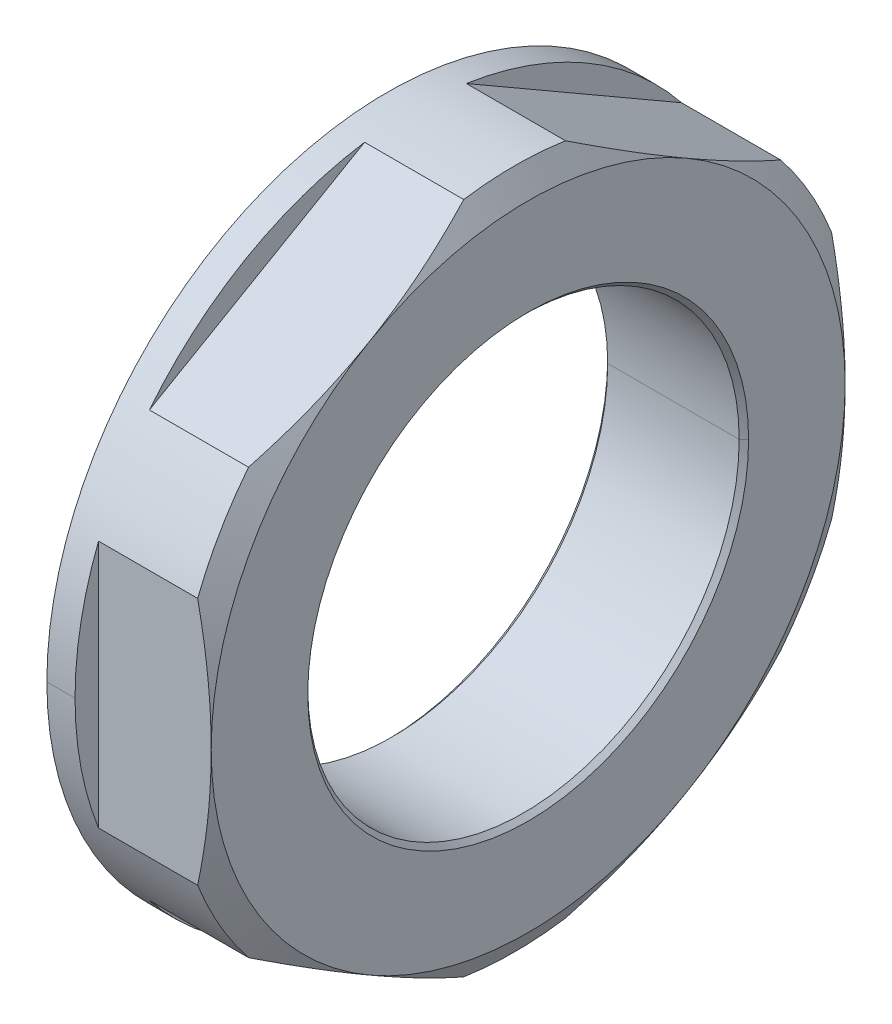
ISO-10303-21;
HEADER;
FILE_DESCRIPTION(('STEP AP214'),'2;1');
FILE_NAME('part.step','',(''),(''),'','','');
FILE_SCHEMA(('AUTOMOTIVE_DESIGN { 1 0 10303 214 1 1 1 1 }'));
ENDSEC;
DATA;
#1=APPLICATION_CONTEXT('core data for automotive mechanical design processes');
#2=APPLICATION_PROTOCOL_DEFINITION('international standard','automotive_design',2000,#1);
#3=PRODUCT_CONTEXT('',#1,'mechanical');
#4=PRODUCT('Part','Part','',(#3));
#5=PRODUCT_RELATED_PRODUCT_CATEGORY('part','',(#4));
#6=PRODUCT_DEFINITION_FORMATION('','',#4);
#7=PRODUCT_DEFINITION_CONTEXT('part definition',#1,'design');
#8=PRODUCT_DEFINITION('design','',#6,#7);
#9=PRODUCT_DEFINITION_SHAPE('','',#8);
#10=(LENGTH_UNIT() NAMED_UNIT(*) SI_UNIT(.MILLI.,.METRE.));
#11=(NAMED_UNIT(*) PLANE_ANGLE_UNIT() SI_UNIT($,.RADIAN.));
#12=(NAMED_UNIT(*) SI_UNIT($,.STERADIAN.) SOLID_ANGLE_UNIT());
#13=UNCERTAINTY_MEASURE_WITH_UNIT(LENGTH_MEASURE(1.E-05),#10,'distance_accuracy_value','');
#14=(GEOMETRIC_REPRESENTATION_CONTEXT(3) GLOBAL_UNCERTAINTY_ASSIGNED_CONTEXT((#13)) GLOBAL_UNIT_ASSIGNED_CONTEXT((#10,
#11,#12)) REPRESENTATION_CONTEXT('',''));
#15=CARTESIAN_POINT('',(0.,0.,0.));
#16=DIRECTION('',(0.,0.,1.));
#17=DIRECTION('',(1.,0.,0.));
#18=AXIS2_PLACEMENT_3D('',#15,#16,#17);
#19=CARTESIAN_POINT('',(6.,0.,0.));
#20=DIRECTION('',(1.,0.,0.));
#21=DIRECTION('',(0.,1.,0.));
#22=AXIS2_PLACEMENT_3D('',#19,#20,#21);
#23=CYLINDRICAL_SURFACE('',#22,14.5);
#24=DIRECTION('',(1.,0.,0.));
#25=VECTOR('',#24,1.);
#26=CARTESIAN_POINT('',(0.,0.,14.5));
#27=LINE('',#26,#25);
#28=CARTESIAN_POINT('',(0.,0.,14.5));
#29=VERTEX_POINT('',#28);
#30=CARTESIAN_POINT('',(1.2,0.,14.5));
#31=VERTEX_POINT('',#30);
#32=EDGE_CURVE('E9',#29,#31,#27,.T.);
#33=ORIENTED_EDGE('',*,*,#32,.F.);
#34=CARTESIAN_POINT('',(0.,0.,0.));
#35=DIRECTION('',(1.,0.,0.));
#36=DIRECTION('',(0.,0.,-1.));
#37=AXIS2_PLACEMENT_3D('',#34,#35,#36);
#38=CIRCLE('',#37,14.5);
#39=CARTESIAN_POINT('',(0.,0.,-14.5));
#40=VERTEX_POINT('',#39);
#41=EDGE_CURVE('E23',#29,#40,#38,.T.);
#42=ORIENTED_EDGE('',*,*,#41,.T.);
#43=DIRECTION('',(1.,0.,0.));
#44=VECTOR('',#43,1.);
#45=CARTESIAN_POINT('',(0.,0.,-14.5));
#46=LINE('',#45,#44);
#47=CARTESIAN_POINT('',(1.2,0.,-14.5));
#48=VERTEX_POINT('',#47);
#49=EDGE_CURVE('E369',#40,#48,#46,.T.);
#50=ORIENTED_EDGE('',*,*,#49,.T.);
#51=CARTESIAN_POINT('',(1.2,0.,0.));
#52=DIRECTION('',(1.,0.,0.));
#53=DIRECTION('',(0.,0.,-1.));
#54=AXIS2_PLACEMENT_3D('',#51,#52,#53);
#55=CIRCLE('',#54,14.5);
#56=CARTESIAN_POINT('',(1.2,-5.29150262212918,-13.5));
#57=VERTEX_POINT('',#56);
#58=EDGE_CURVE('E364',#57,#48,#55,.T.);
#59=ORIENTED_EDGE('',*,*,#58,.F.);
#60=DIRECTION('',(-1.,0.,0.));
#61=VECTOR('',#60,1.);
#62=CARTESIAN_POINT('',(6.,-5.29150262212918,-13.5));
#63=LINE('',#62,#61);
#64=CARTESIAN_POINT('',(5.4226497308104,-5.29150262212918,-13.5));
#65=VERTEX_POINT('',#64);
#66=EDGE_CURVE('E352',#65,#57,#63,.T.);
#67=ORIENTED_EDGE('',*,*,#66,.F.);
#68=CARTESIAN_POINT('',(5.4226497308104,0.,0.));
#69=DIRECTION('',(1.,0.,0.));
#70=DIRECTION('',(0.,0.,-1.));
#71=AXIS2_PLACEMENT_3D('',#68,#69,#70);
#72=CIRCLE('',#71,14.5);
#73=CARTESIAN_POINT('',(5.4226497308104,-9.04559164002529,-11.3325756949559));
#74=VERTEX_POINT('',#73);
#75=EDGE_CURVE('E171',#74,#65,#72,.T.);
#76=ORIENTED_EDGE('',*,*,#75,.F.);
#77=DIRECTION('',(1.,0.,0.));
#78=VECTOR('',#77,1.);
#79=CARTESIAN_POINT('',(6.,-9.0455916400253,-11.3325756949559));
#80=LINE('',#79,#78);
#81=CARTESIAN_POINT('',(1.2,-9.0455916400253,-11.3325756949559));
#82=VERTEX_POINT('',#81);
#83=EDGE_CURVE('E346',#82,#74,#80,.T.);
#84=ORIENTED_EDGE('',*,*,#83,.F.);
#85=CARTESIAN_POINT('',(1.2,0.,0.));
#86=DIRECTION('',(1.,0.,0.));
#87=DIRECTION('',(0.,0.,-1.));
#88=AXIS2_PLACEMENT_3D('',#85,#86,#87);
#89=CIRCLE('',#88,14.5);
#90=CARTESIAN_POINT('',(1.2,-14.3370942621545,-2.16742430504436));
#91=VERTEX_POINT('',#90);
#92=EDGE_CURVE('E350',#91,#82,#89,.T.);
#93=ORIENTED_EDGE('',*,*,#92,.F.);
#94=DIRECTION('',(-1.,0.,0.));
#95=VECTOR('',#94,1.);
#96=CARTESIAN_POINT('',(6.,-14.3370942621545,-2.16742430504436));
#97=LINE('',#96,#95);
#98=CARTESIAN_POINT('',(5.4226497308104,-14.3370942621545,-2.16742430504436));
#99=VERTEX_POINT('',#98);
#100=EDGE_CURVE('E354',#99,#91,#97,.T.);
#101=ORIENTED_EDGE('',*,*,#100,.F.);
#102=CARTESIAN_POINT('',(5.4226497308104,0.,0.));
#103=DIRECTION('',(1.,0.,0.));
#104=DIRECTION('',(0.,0.,-1.));
#105=AXIS2_PLACEMENT_3D('',#102,#103,#104);
#106=CIRCLE('',#105,14.5);
#107=CARTESIAN_POINT('',(5.4226497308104,-14.3370942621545,2.16742430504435));
#108=VERTEX_POINT('',#107);
#109=EDGE_CURVE('E727',#108,#99,#106,.T.);
#110=ORIENTED_EDGE('',*,*,#109,.F.);
#111=DIRECTION('',(1.,0.,0.));
#112=VECTOR('',#111,1.);
#113=CARTESIAN_POINT('',(6.,-14.3370942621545,2.16742430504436));
#114=LINE('',#113,#112);
#115=CARTESIAN_POINT('',(1.2,-14.3370942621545,2.16742430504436));
#116=VERTEX_POINT('',#115);
#117=EDGE_CURVE('E729',#116,#108,#114,.T.);
#118=ORIENTED_EDGE('',*,*,#117,.F.);
#119=CARTESIAN_POINT('',(1.2,0.,0.));
#120=DIRECTION('',(1.,0.,0.));
#121=DIRECTION('',(0.,0.,-1.));
#122=AXIS2_PLACEMENT_3D('',#119,#120,#121);
#123=CIRCLE('',#122,14.5);
#124=CARTESIAN_POINT('',(1.2,-9.04559164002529,11.3325756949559));
#125=VERTEX_POINT('',#124);
#126=EDGE_CURVE('E731',#125,#116,#123,.T.);
#127=ORIENTED_EDGE('',*,*,#126,.F.);
#128=DIRECTION('',(-1.,0.,0.));
#129=VECTOR('',#128,1.);
#130=CARTESIAN_POINT('',(6.,-9.04559164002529,11.3325756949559));
#131=LINE('',#130,#129);
#132=CARTESIAN_POINT('',(5.4226497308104,-9.04559164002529,11.3325756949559));
#133=VERTEX_POINT('',#132);
#134=EDGE_CURVE('E744',#133,#125,#131,.T.);
#135=ORIENTED_EDGE('',*,*,#134,.F.);
#136=CARTESIAN_POINT('',(5.4226497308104,0.,0.));
#137=DIRECTION('',(1.,0.,0.));
#138=DIRECTION('',(0.,0.,-1.));
#139=AXIS2_PLACEMENT_3D('',#136,#137,#138);
#140=CIRCLE('',#139,14.5);
#141=CARTESIAN_POINT('',(5.4226497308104,-5.29150262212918,13.5));
#142=VERTEX_POINT('',#141);
#143=EDGE_CURVE('E718',#142,#133,#140,.T.);
#144=ORIENTED_EDGE('',*,*,#143,.F.);
#145=DIRECTION('',(1.,0.,0.));
#146=VECTOR('',#145,1.);
#147=CARTESIAN_POINT('',(6.,-5.29150262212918,13.5));
#148=LINE('',#147,#146);
#149=CARTESIAN_POINT('',(1.2,-5.29150262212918,13.5));
#150=VERTEX_POINT('',#149);
#151=EDGE_CURVE('E751',#150,#142,#148,.T.);
#152=ORIENTED_EDGE('',*,*,#151,.F.);
#153=CARTESIAN_POINT('',(1.2,0.,0.));
#154=DIRECTION('',(1.,0.,0.));
#155=DIRECTION('',(0.,0.,-1.));
#156=AXIS2_PLACEMENT_3D('',#153,#154,#155);
#157=CIRCLE('',#156,14.5);
#158=EDGE_CURVE('E755',#31,#150,#157,.T.);
#159=ORIENTED_EDGE('',*,*,#158,.F.);
#160=EDGE_LOOP('',(#33,#42,#50,#59,#67,#76,#84,#93,#101,#110,#118,#127,#135,#144,#152,#159));
#161=FACE_BOUND('',#160,.T.);
#162=ADVANCED_FACE('F15',(#161),#23,.T.);
#163=CARTESIAN_POINT('',(1.2,0.,0.));
#164=DIRECTION('',(1.,0.,0.));
#165=DIRECTION('',(0.,0.,-1.));
#166=AXIS2_PLACEMENT_3D('',#163,#164,#165);
#167=PLANE('',#166);
#168=CARTESIAN_POINT('',(1.2,0.,0.));
#169=DIRECTION('',(1.,0.,0.));
#170=DIRECTION('',(0.,0.,-1.));
#171=AXIS2_PLACEMENT_3D('',#168,#169,#170);
#172=CIRCLE('',#171,14.5);
#173=CARTESIAN_POINT('',(1.2,5.29150262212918,13.5));
#174=VERTEX_POINT('',#173);
#175=EDGE_CURVE('E594',#174,#31,#172,.T.);
#176=ORIENTED_EDGE('',*,*,#175,.T.);
#177=ORIENTED_EDGE('',*,*,#158,.T.);
#178=DIRECTION('',(0.,-1.,0.));
#179=VECTOR('',#178,1.);
#180=CARTESIAN_POINT('',(1.2,7.7942286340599,13.5));
#181=LINE('',#180,#179);
#182=EDGE_CURVE('E763',#174,#150,#181,.T.);
#183=ORIENTED_EDGE('',*,*,#182,.F.);
#184=EDGE_LOOP('',(#176,#177,#183));
#185=FACE_BOUND('',#184,.T.);
#186=ADVANCED_FACE('F554',(#185),#167,.T.);
#187=CARTESIAN_POINT('',(1.2,7.7942286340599,13.5));
#188=DIRECTION('',(0.,0.,1.));
#189=DIRECTION('',(1.,0.,0.));
#190=AXIS2_PLACEMENT_3D('',#187,#188,#189);
#191=PLANE('',#190);
#192=ORIENTED_EDGE('',*,*,#151,.T.);
#193=CARTESIAN_POINT('',(5.4226497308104,-5.29150262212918,13.5));
#194=CARTESIAN_POINT('',(5.60515162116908,-4.42530501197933,13.5));
#195=CARTESIAN_POINT('',(5.75181855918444,-3.54063507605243,13.5));
#196=CARTESIAN_POINT('',(5.94826501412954,-1.78113805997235,13.5));
#197=CARTESIAN_POINT('',(6.,-0.885214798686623,13.5));
#198=CARTESIAN_POINT('',(6.,0.,13.5));
#199=B_SPLINE_CURVE_WITH_KNOTS('',3,(#193,#194,#195,#196,#197,#198),.UNSPECIFIED.,.F.,.F.,(4,2,
4),(0.,0.5,1.),.UNSPECIFIED.);
#200=CARTESIAN_POINT('',(6.,0.,13.5));
#201=VERTEX_POINT('',#200);
#202=EDGE_CURVE('E236',#142,#201,#199,.T.);
#203=ORIENTED_EDGE('',*,*,#202,.T.);
#204=CARTESIAN_POINT('',(6.,0.,13.5));
#205=CARTESIAN_POINT('',(6.,0.0497202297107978,13.5));
#206=CARTESIAN_POINT('',(5.99983110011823,0.101835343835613,13.5));
#207=CARTESIAN_POINT('',(5.99393729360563,1.01122228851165,13.5));
#208=CARTESIAN_POINT('',(5.93947331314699,1.88208085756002,13.5));
#209=CARTESIAN_POINT('',(5.74357129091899,3.59025567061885,13.5));
#210=CARTESIAN_POINT('',(5.59988839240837,4.45028555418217,13.5));
#211=CARTESIAN_POINT('',(5.4226497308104,5.29150262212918,13.5));
#212=B_SPLINE_CURVE_WITH_KNOTS('',3,(#204,#205,#206,#207,#208,#209,#210,#211),.UNSPECIFIED.,.F.,
.F.,(4,2,2,4),(0.,0.0281049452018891,0.514052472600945,1.),.UNSPECIFIED.);
#213=CARTESIAN_POINT('',(5.4226497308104,5.29150262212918,13.5));
#214=VERTEX_POINT('',#213);
#215=EDGE_CURVE('E520',#201,#214,#212,.T.);
#216=ORIENTED_EDGE('',*,*,#215,.T.);
#217=DIRECTION('',(-1.,0.,0.));
#218=VECTOR('',#217,1.);
#219=CARTESIAN_POINT('',(6.,5.29150262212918,13.5));
#220=LINE('',#219,#218);
#221=EDGE_CURVE('E589',#214,#174,#220,.T.);
#222=ORIENTED_EDGE('',*,*,#221,.T.);
#223=ORIENTED_EDGE('',*,*,#182,.T.);
#224=EDGE_LOOP('',(#192,#203,#216,#222,#223));
#225=FACE_BOUND('',#224,.T.);
#226=ADVANCED_FACE('F558',(#225),#191,.T.);
#227=CARTESIAN_POINT('',(6.,0.,0.));
#228=DIRECTION('',(1.,0.,0.));
#229=DIRECTION('',(0.,-1.,0.));
#230=AXIS2_PLACEMENT_3D('',#227,#228,#229);
#231=CYLINDRICAL_SURFACE('',#230,14.5);
#232=ORIENTED_EDGE('',*,*,#32,.T.);
#233=ORIENTED_EDGE('',*,*,#175,.F.);
#234=ORIENTED_EDGE('',*,*,#221,.F.);
#235=CARTESIAN_POINT('',(5.4226497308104,0.,0.));
#236=DIRECTION('',(1.,0.,0.));
#237=DIRECTION('',(0.,0.,-1.));
#238=AXIS2_PLACEMENT_3D('',#235,#236,#237);
#239=CIRCLE('',#238,14.5);
#240=CARTESIAN_POINT('',(5.4226497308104,9.04559164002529,11.3325756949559));
#241=VERTEX_POINT('',#240);
#242=EDGE_CURVE('E591',#241,#214,#239,.T.);
#243=ORIENTED_EDGE('',*,*,#242,.F.);
#244=DIRECTION('',(1.,0.,0.));
#245=VECTOR('',#244,1.);
#246=CARTESIAN_POINT('',(6.,9.0455916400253,11.3325756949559));
#247=LINE('',#246,#245);
#248=CARTESIAN_POINT('',(1.2,9.0455916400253,11.3325756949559));
#249=VERTEX_POINT('',#248);
#250=EDGE_CURVE('E592',#249,#241,#247,.T.);
#251=ORIENTED_EDGE('',*,*,#250,.F.);
#252=CARTESIAN_POINT('',(1.2,0.,0.));
#253=DIRECTION('',(1.,0.,0.));
#254=DIRECTION('',(0.,0.,-1.));
#255=AXIS2_PLACEMENT_3D('',#252,#253,#254);
#256=CIRCLE('',#255,14.5);
#257=CARTESIAN_POINT('',(1.2,14.3370942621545,2.16742430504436));
#258=VERTEX_POINT('',#257);
#259=EDGE_CURVE('E601',#258,#249,#256,.T.);
#260=ORIENTED_EDGE('',*,*,#259,.F.);
#261=DIRECTION('',(-1.,0.,0.));
#262=VECTOR('',#261,1.);
#263=CARTESIAN_POINT('',(6.,14.3370942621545,2.16742430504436));
#264=LINE('',#263,#262);
#265=CARTESIAN_POINT('',(5.4226497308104,14.3370942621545,2.16742430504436));
#266=VERTEX_POINT('',#265);
#267=EDGE_CURVE('E605',#266,#258,#264,.T.);
#268=ORIENTED_EDGE('',*,*,#267,.F.);
#269=CARTESIAN_POINT('',(5.4226497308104,0.,0.));
#270=DIRECTION('',(1.,0.,0.));
#271=DIRECTION('',(0.,0.,-1.));
#272=AXIS2_PLACEMENT_3D('',#269,#270,#271);
#273=CIRCLE('',#272,14.5);
#274=CARTESIAN_POINT('',(5.4226497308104,14.3370942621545,-2.16742430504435));
#275=VERTEX_POINT('',#274);
#276=EDGE_CURVE('E609',#275,#266,#273,.T.);
#277=ORIENTED_EDGE('',*,*,#276,.F.);
#278=DIRECTION('',(1.,0.,0.));
#279=VECTOR('',#278,1.);
#280=CARTESIAN_POINT('',(6.,14.3370942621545,-2.16742430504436));
#281=LINE('',#280,#279);
#282=CARTESIAN_POINT('',(1.2,14.3370942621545,-2.16742430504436));
#283=VERTEX_POINT('',#282);
#284=EDGE_CURVE('E613',#283,#275,#281,.T.);
#285=ORIENTED_EDGE('',*,*,#284,.F.);
#286=CARTESIAN_POINT('',(1.2,0.,0.));
#287=DIRECTION('',(1.,0.,0.));
#288=DIRECTION('',(0.,0.,-1.));
#289=AXIS2_PLACEMENT_3D('',#286,#287,#288);
#290=CIRCLE('',#289,14.5);
#291=CARTESIAN_POINT('',(1.2,9.04559164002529,-11.3325756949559));
#292=VERTEX_POINT('',#291);
#293=EDGE_CURVE('E617',#292,#283,#290,.T.);
#294=ORIENTED_EDGE('',*,*,#293,.F.);
#295=DIRECTION('',(-1.,0.,0.));
#296=VECTOR('',#295,1.);
#297=CARTESIAN_POINT('',(6.,9.04559164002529,-11.3325756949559));
#298=LINE('',#297,#296);
#299=CARTESIAN_POINT('',(5.4226497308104,9.04559164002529,-11.3325756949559));
#300=VERTEX_POINT('',#299);
#301=EDGE_CURVE('E622',#300,#292,#298,.T.);
#302=ORIENTED_EDGE('',*,*,#301,.F.);
#303=CARTESIAN_POINT('',(5.4226497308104,0.,0.));
#304=DIRECTION('',(1.,0.,0.));
#305=DIRECTION('',(0.,0.,-1.));
#306=AXIS2_PLACEMENT_3D('',#303,#304,#305);
#307=CIRCLE('',#306,14.5);
#308=CARTESIAN_POINT('',(5.4226497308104,5.29150262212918,-13.5));
#309=VERTEX_POINT('',#308);
#310=EDGE_CURVE('E626',#309,#300,#307,.T.);
#311=ORIENTED_EDGE('',*,*,#310,.F.);
#312=DIRECTION('',(1.,0.,0.));
#313=VECTOR('',#312,1.);
#314=CARTESIAN_POINT('',(6.,5.29150262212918,-13.5));
#315=LINE('',#314,#313);
#316=CARTESIAN_POINT('',(1.2,5.29150262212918,-13.5));
#317=VERTEX_POINT('',#316);
#318=EDGE_CURVE('E195',#317,#309,#315,.T.);
#319=ORIENTED_EDGE('',*,*,#318,.F.);
#320=CARTESIAN_POINT('',(1.2,0.,0.));
#321=DIRECTION('',(1.,0.,0.));
#322=DIRECTION('',(0.,0.,-1.));
#323=AXIS2_PLACEMENT_3D('',#320,#321,#322);
#324=CIRCLE('',#323,14.5);
#325=EDGE_CURVE('E382',#48,#317,#324,.T.);
#326=ORIENTED_EDGE('',*,*,#325,.F.);
#327=ORIENTED_EDGE('',*,*,#49,.F.);
#328=CARTESIAN_POINT('',(0.,0.,0.));
#329=DIRECTION('',(1.,0.,0.));
#330=DIRECTION('',(0.,0.,-1.));
#331=AXIS2_PLACEMENT_3D('',#328,#329,#330);
#332=CIRCLE('',#331,14.5);
#333=EDGE_CURVE('E385',#40,#29,#332,.T.);
#334=ORIENTED_EDGE('',*,*,#333,.T.);
#335=EDGE_LOOP('',(#232,#233,#234,#243,#251,#260,#268,#277,#285,#294,#302,#311,#319,#326,#327,#334));
#336=FACE_BOUND('',#335,.T.);
#337=ADVANCED_FACE('F383',(#336),#231,.T.);
#338=CARTESIAN_POINT('',(0.,0.,0.));
#339=DIRECTION('',(1.,0.,0.));
#340=DIRECTION('',(0.,0.,-1.));
#341=AXIS2_PLACEMENT_3D('',#338,#339,#340);
#342=PLANE('',#341);
#343=ORIENTED_EDGE('',*,*,#41,.F.);
#344=ORIENTED_EDGE('',*,*,#333,.F.);
#345=EDGE_LOOP('',(#343,#344));
#346=FACE_BOUND('',#345,.T.);
#347=CARTESIAN_POINT('',(0.,0.,0.));
#348=DIRECTION('',(1.,0.,0.));
#349=DIRECTION('',(0.,0.,-1.));
#350=AXIS2_PLACEMENT_3D('',#347,#348,#349);
#351=CIRCLE('',#350,9.388);
#352=CARTESIAN_POINT('',(0.,0.,-9.388));
#353=VERTEX_POINT('',#352);
#354=CARTESIAN_POINT('',(0.,0.,9.388));
#355=VERTEX_POINT('',#354);
#356=EDGE_CURVE('E638',#353,#355,#351,.T.);
#357=ORIENTED_EDGE('',*,*,#356,.T.);
#358=CARTESIAN_POINT('',(0.,0.,0.));
#359=DIRECTION('',(1.,0.,0.));
#360=DIRECTION('',(0.,0.,-1.));
#361=AXIS2_PLACEMENT_3D('',#358,#359,#360);
#362=CIRCLE('',#361,9.388);
#363=EDGE_CURVE('E642',#355,#353,#362,.T.);
#364=ORIENTED_EDGE('',*,*,#363,.T.);
#365=EDGE_LOOP('',(#357,#364));
#366=FACE_BOUND('',#365,.T.);
#367=ADVANCED_FACE('F965',(#346,#366),#342,.F.);
#368=CARTESIAN_POINT('',(0.,0.,0.));
#369=DIRECTION('',(-1.,0.,0.));
#370=DIRECTION('',(0.,1.,0.));
#371=AXIS2_PLACEMENT_3D('',#368,#369,#370);
#372=CONICAL_SURFACE('',#371,9.388,0.78539816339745);
#373=DIRECTION('',(-0.707106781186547,0.,-0.707106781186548));
#374=VECTOR('',#373,1.);
#375=CARTESIAN_POINT('',(0.199999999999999,0.,-9.188));
#376=LINE('',#375,#374);
#377=CARTESIAN_POINT('',(0.2,0.,-9.188));
#378=VERTEX_POINT('',#377);
#379=EDGE_CURVE('E646',#378,#353,#376,.T.);
#380=ORIENTED_EDGE('',*,*,#379,.T.);
#381=ORIENTED_EDGE('',*,*,#363,.F.);
#382=DIRECTION('',(-0.707106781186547,0.,0.707106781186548));
#383=VECTOR('',#382,1.);
#384=CARTESIAN_POINT('',(0.199999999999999,0.,9.188));
#385=LINE('',#384,#383);
#386=CARTESIAN_POINT('',(0.199999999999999,0.,9.188));
#387=VERTEX_POINT('',#386);
#388=EDGE_CURVE('E651',#387,#355,#385,.T.);
#389=ORIENTED_EDGE('',*,*,#388,.F.);
#390=CARTESIAN_POINT('',(0.2,0.,0.));
#391=DIRECTION('',(1.,0.,0.));
#392=DIRECTION('',(0.,0.,-1.));
#393=AXIS2_PLACEMENT_3D('',#390,#391,#392);
#394=CIRCLE('',#393,9.188);
#395=EDGE_CURVE('E656',#387,#378,#394,.T.);
#396=ORIENTED_EDGE('',*,*,#395,.T.);
#397=EDGE_LOOP('',(#380,#381,#389,#396));
#398=FACE_BOUND('',#397,.T.);
#399=ADVANCED_FACE('F955',(#398),#372,.F.);
#400=CARTESIAN_POINT('',(6.,0.,0.));
#401=DIRECTION('',(1.,0.,0.));
#402=DIRECTION('',(0.,1.,0.));
#403=AXIS2_PLACEMENT_3D('',#400,#401,#402);
#404=CYLINDRICAL_SURFACE('',#403,9.188);
#405=DIRECTION('',(1.,0.,0.));
#406=VECTOR('',#405,1.);
#407=CARTESIAN_POINT('',(0.2,0.,9.188));
#408=LINE('',#407,#406);
#409=CARTESIAN_POINT('',(5.8,0.,9.188));
#410=VERTEX_POINT('',#409);
#411=EDGE_CURVE('E660',#387,#410,#408,.T.);
#412=ORIENTED_EDGE('',*,*,#411,.T.);
#413=CARTESIAN_POINT('',(5.8,0.,0.));
#414=DIRECTION('',(1.,0.,0.));
#415=DIRECTION('',(0.,0.,-1.));
#416=AXIS2_PLACEMENT_3D('',#413,#414,#415);
#417=CIRCLE('',#416,9.188);
#418=CARTESIAN_POINT('',(5.8,0.,-9.188));
#419=VERTEX_POINT('',#418);
#420=EDGE_CURVE('E664',#410,#419,#417,.T.);
#421=ORIENTED_EDGE('',*,*,#420,.T.);
#422=DIRECTION('',(1.,0.,0.));
#423=VECTOR('',#422,1.);
#424=CARTESIAN_POINT('',(0.2,0.,-9.188));
#425=LINE('',#424,#423);
#426=EDGE_CURVE('E668',#378,#419,#425,.T.);
#427=ORIENTED_EDGE('',*,*,#426,.F.);
#428=ORIENTED_EDGE('',*,*,#395,.F.);
#429=EDGE_LOOP('',(#412,#421,#427,#428));
#430=FACE_BOUND('',#429,.T.);
#431=ADVANCED_FACE('F945',(#430),#404,.F.);
#432=CARTESIAN_POINT('',(6.,0.,0.));
#433=DIRECTION('',(1.,0.,0.));
#434=DIRECTION('',(0.,-1.,0.));
#435=AXIS2_PLACEMENT_3D('',#432,#433,#434);
#436=CYLINDRICAL_SURFACE('',#435,9.188);
#437=ORIENTED_EDGE('',*,*,#411,.F.);
#438=CARTESIAN_POINT('',(0.2,0.,0.));
#439=DIRECTION('',(1.,0.,0.));
#440=DIRECTION('',(0.,0.,-1.));
#441=AXIS2_PLACEMENT_3D('',#438,#439,#440);
#442=CIRCLE('',#441,9.188);
#443=EDGE_CURVE('E673',#378,#387,#442,.T.);
#444=ORIENTED_EDGE('',*,*,#443,.F.);
#445=ORIENTED_EDGE('',*,*,#426,.T.);
#446=CARTESIAN_POINT('',(5.8,0.,0.));
#447=DIRECTION('',(1.,0.,0.));
#448=DIRECTION('',(0.,0.,-1.));
#449=AXIS2_PLACEMENT_3D('',#446,#447,#448);
#450=CIRCLE('',#449,9.188);
#451=EDGE_CURVE('E678',#419,#410,#450,.T.);
#452=ORIENTED_EDGE('',*,*,#451,.T.);
#453=EDGE_LOOP('',(#437,#444,#445,#452));
#454=FACE_BOUND('',#453,.T.);
#455=ADVANCED_FACE('F935',(#454),#436,.F.);
#456=CARTESIAN_POINT('',(5.8,0.,0.));
#457=DIRECTION('',(1.,0.,0.));
#458=DIRECTION('',(0.,-1.,0.));
#459=AXIS2_PLACEMENT_3D('',#456,#457,#458);
#460=CONICAL_SURFACE('',#459,9.188,0.785398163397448);
#461=DIRECTION('',(0.707106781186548,0.,0.707106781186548));
#462=VECTOR('',#461,1.);
#463=CARTESIAN_POINT('',(5.8,0.,9.188));
#464=LINE('',#463,#462);
#465=CARTESIAN_POINT('',(6.,0.,9.388));
#466=VERTEX_POINT('',#465);
#467=EDGE_CURVE('E683',#410,#466,#464,.T.);
#468=ORIENTED_EDGE('',*,*,#467,.F.);
#469=ORIENTED_EDGE('',*,*,#451,.F.);
#470=DIRECTION('',(0.707106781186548,0.,-0.707106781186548));
#471=VECTOR('',#470,1.);
#472=CARTESIAN_POINT('',(5.8,0.,-9.188));
#473=LINE('',#472,#471);
#474=CARTESIAN_POINT('',(6.,0.,-9.388));
#475=VERTEX_POINT('',#474);
#476=EDGE_CURVE('E688',#419,#475,#473,.T.);
#477=ORIENTED_EDGE('',*,*,#476,.T.);
#478=CARTESIAN_POINT('',(6.,0.,0.));
#479=DIRECTION('',(1.,0.,0.));
#480=DIRECTION('',(0.,0.,-1.));
#481=AXIS2_PLACEMENT_3D('',#478,#479,#480);
#482=CIRCLE('',#481,9.388);
#483=EDGE_CURVE('E692',#475,#466,#482,.T.);
#484=ORIENTED_EDGE('',*,*,#483,.T.);
#485=EDGE_LOOP('',(#468,#469,#477,#484));
#486=FACE_BOUND('',#485,.T.);
#487=ADVANCED_FACE('F926',(#486),#460,.F.);
#488=CARTESIAN_POINT('',(6.,13.5,0.));
#489=DIRECTION('',(-1.,0.,0.));
#490=DIRECTION('',(0.,0.,1.));
#491=AXIS2_PLACEMENT_3D('',#488,#489,#490);
#492=PLANE('',#491);
#493=CARTESIAN_POINT('',(6.,0.,0.));
#494=DIRECTION('',(1.,0.,0.));
#495=DIRECTION('',(0.,0.,-1.));
#496=AXIS2_PLACEMENT_3D('',#493,#494,#495);
#497=CIRCLE('',#496,9.388);
#498=EDGE_CURVE('E189',#466,#475,#497,.T.);
#499=ORIENTED_EDGE('',*,*,#498,.F.);
#500=ORIENTED_EDGE('',*,*,#483,.F.);
#501=EDGE_LOOP('',(#499,#500));
#502=FACE_BOUND('',#501,.T.);
#503=CARTESIAN_POINT('',(6.,0.,0.));
#504=DIRECTION('',(1.,0.,0.));
#505=DIRECTION('',(0.,0.,-1.));
#506=AXIS2_PLACEMENT_3D('',#503,#504,#505);
#507=CIRCLE('',#506,13.5);
#508=CARTESIAN_POINT('',(6.,0.,-13.5));
#509=VERTEX_POINT('',#508);
#510=CARTESIAN_POINT('',(6.,11.6913429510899,-6.75000000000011));
#511=VERTEX_POINT('',#510);
#512=EDGE_CURVE('E157',#509,#511,#507,.T.);
#513=ORIENTED_EDGE('',*,*,#512,.T.);
#514=CARTESIAN_POINT('',(6.,0.,0.));
#515=DIRECTION('',(1.,0.,0.));
#516=DIRECTION('',(0.,0.,-1.));
#517=AXIS2_PLACEMENT_3D('',#514,#515,#516);
#518=CIRCLE('',#517,13.5);
#519=CARTESIAN_POINT('',(6.,11.6913429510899,6.75000000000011));
#520=VERTEX_POINT('',#519);
#521=EDGE_CURVE('E190',#511,#520,#518,.T.);
#522=ORIENTED_EDGE('',*,*,#521,.T.);
#523=CARTESIAN_POINT('',(6.,0.,0.));
#524=DIRECTION('',(1.,0.,0.));
#525=DIRECTION('',(0.,0.,-1.));
#526=AXIS2_PLACEMENT_3D('',#523,#524,#525);
#527=CIRCLE('',#526,13.5);
#528=EDGE_CURVE('E705',#520,#201,#527,.T.);
#529=ORIENTED_EDGE('',*,*,#528,.T.);
#530=CARTESIAN_POINT('',(6.,0.,0.));
#531=DIRECTION('',(1.,0.,0.));
#532=DIRECTION('',(0.,0.,-1.));
#533=AXIS2_PLACEMENT_3D('',#530,#531,#532);
#534=CIRCLE('',#533,13.5);
#535=CARTESIAN_POINT('',(6.,-11.6913429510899,6.75000000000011));
#536=VERTEX_POINT('',#535);
#537=EDGE_CURVE('E710',#201,#536,#534,.T.);
#538=ORIENTED_EDGE('',*,*,#537,.T.);
#539=CARTESIAN_POINT('',(6.,0.,0.));
#540=DIRECTION('',(1.,0.,0.));
#541=DIRECTION('',(0.,0.,-1.));
#542=AXIS2_PLACEMENT_3D('',#539,#540,#541);
#543=CIRCLE('',#542,13.5);
#544=CARTESIAN_POINT('',(6.,-11.6913429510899,-6.75000000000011));
#545=VERTEX_POINT('',#544);
#546=EDGE_CURVE('E160',#536,#545,#543,.T.);
#547=ORIENTED_EDGE('',*,*,#546,.T.);
#548=CARTESIAN_POINT('',(6.,0.,0.));
#549=DIRECTION('',(1.,0.,0.));
#550=DIRECTION('',(0.,0.,-1.));
#551=AXIS2_PLACEMENT_3D('',#548,#549,#550);
#552=CIRCLE('',#551,13.5);
#553=EDGE_CURVE('E153',#545,#509,#552,.T.);
#554=ORIENTED_EDGE('',*,*,#553,.T.);
#555=EDGE_LOOP('',(#513,#522,#529,#538,#547,#554));
#556=FACE_BOUND('',#555,.T.);
#557=ADVANCED_FACE('F155',(#502,#556),#492,.F.);
#558=CARTESIAN_POINT('',(5.4226497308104,0.,0.));
#559=DIRECTION('',(-1.,0.,0.));
#560=DIRECTION('',(0.,0.499999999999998,0.86602540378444));
#561=AXIS2_PLACEMENT_3D('',#558,#559,#560);
#562=CONICAL_SURFACE('',#561,14.5,1.04719755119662);
#563=CARTESIAN_POINT('',(6.,0.,-13.5));
#564=CARTESIAN_POINT('',(6.,-0.0497202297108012,-13.5));
#565=CARTESIAN_POINT('',(5.99983110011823,-0.101835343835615,-13.5));
#566=CARTESIAN_POINT('',(5.99393729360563,-1.01122228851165,-13.5));
#567=CARTESIAN_POINT('',(5.93947331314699,-1.88208085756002,-13.5));
#568=CARTESIAN_POINT('',(5.74357129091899,-3.59025567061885,-13.5));
#569=CARTESIAN_POINT('',(5.59988839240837,-4.45028555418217,-13.5));
#570=CARTESIAN_POINT('',(5.4226497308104,-5.29150262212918,-13.5));
#571=B_SPLINE_CURVE_WITH_KNOTS('',3,(#563,#564,#565,#566,#567,#568,#569,#570),.UNSPECIFIED.,.F.,
.F.,(4,2,2,4),(0.,0.0281049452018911,0.514052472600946,1.),.UNSPECIFIED.);
#572=EDGE_CURVE('E165',#509,#65,#571,.T.);
#573=ORIENTED_EDGE('',*,*,#572,.F.);
#574=ORIENTED_EDGE('',*,*,#553,.F.);
#575=CARTESIAN_POINT('',(5.4224497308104,-9.04511705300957,-11.3333977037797));
#576=CARTESIAN_POINT('',(5.60515606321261,-9.4786336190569,-10.582524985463));
#577=CARTESIAN_POINT('',(5.75165239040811,-9.9203580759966,-9.81743578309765));
#578=CARTESIAN_POINT('',(5.94832350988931,-10.8009591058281,-8.29219005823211));
#579=CARTESIAN_POINT('',(5.99999999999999,-11.2483056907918,-7.51736304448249));
#580=CARTESIAN_POINT('',(5.99999999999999,-11.6913429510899,-6.7500000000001));
#581=B_SPLINE_CURVE_WITH_KNOTS('',3,(#575,#576,#577,#578,#579,#580),.UNSPECIFIED.,.F.,.F.,(4,2,
4),(0.,0.5,1.),.UNSPECIFIED.);
#582=EDGE_CURVE('E176',#74,#545,#581,.T.);
#583=ORIENTED_EDGE('',*,*,#582,.F.);
#584=ORIENTED_EDGE('',*,*,#75,.T.);
#585=EDGE_LOOP('',(#573,#574,#583,#584));
#586=FACE_BOUND('',#585,.T.);
#587=ADVANCED_FACE('F170',(#586),#562,.T.);
#588=CARTESIAN_POINT('',(1.2,-15.58845726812,0.));
#589=DIRECTION('',(0.,-0.866025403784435,-0.500000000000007));
#590=DIRECTION('',(0.,0.500000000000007,-0.866025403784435));
#591=AXIS2_PLACEMENT_3D('',#588,#589,#590);
#592=PLANE('',#591);
#593=ORIENTED_EDGE('',*,*,#83,.T.);
#594=ORIENTED_EDGE('',*,*,#582,.T.);
#595=CARTESIAN_POINT('',(5.99999999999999,-11.6913429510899,-6.7500000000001));
#596=CARTESIAN_POINT('',(5.99999999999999,-12.1154554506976,-6.01541560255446));
#597=CARTESIAN_POINT('',(5.95208164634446,-12.5478568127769,-5.26647447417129));
#598=CARTESIAN_POINT('',(5.76283227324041,-13.4287435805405,-3.74073383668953));
#599=CARTESIAN_POINT('',(5.61291103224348,-13.8856516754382,-2.94934580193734));
#600=CARTESIAN_POINT('',(5.42244973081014,-14.3375688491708,-2.16660229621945));
#601=B_SPLINE_CURVE_WITH_KNOTS('',3,(#595,#596,#597,#598,#599,#600),.UNSPECIFIED.,.F.,.F.,(4,2,
4),(0.,0.478706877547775,1.),.UNSPECIFIED.);
#602=EDGE_CURVE('E296',#545,#99,#601,.T.);
#603=ORIENTED_EDGE('',*,*,#602,.T.);
#604=ORIENTED_EDGE('',*,*,#100,.T.);
#605=DIRECTION('',(0.,0.500000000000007,-0.866025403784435));
#606=VECTOR('',#605,1.);
#607=CARTESIAN_POINT('',(1.2,-15.58845726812,0.));
#608=LINE('',#607,#606);
#609=EDGE_CURVE('E297',#91,#82,#608,.T.);
#610=ORIENTED_EDGE('',*,*,#609,.T.);
#611=EDGE_LOOP('',(#593,#594,#603,#604,#610));
#612=FACE_BOUND('',#611,.T.);
#613=ADVANCED_FACE('F307',(#612),#592,.T.);
#614=CARTESIAN_POINT('',(1.2,0.,0.));
#615=DIRECTION('',(1.,0.,0.));
#616=DIRECTION('',(0.,0.,-1.));
#617=AXIS2_PLACEMENT_3D('',#614,#615,#616);
#618=PLANE('',#617);
#619=ORIENTED_EDGE('',*,*,#92,.T.);
#620=ORIENTED_EDGE('',*,*,#609,.F.);
#621=EDGE_LOOP('',(#619,#620));
#622=FACE_BOUND('',#621,.T.);
#623=ADVANCED_FACE('F316',(#622),#618,.T.);
#624=CARTESIAN_POINT('',(5.4226497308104,0.,0.));
#625=DIRECTION('',(-1.,0.,0.));
#626=DIRECTION('',(0.,1.,0.));
#627=AXIS2_PLACEMENT_3D('',#624,#625,#626);
#628=CONICAL_SURFACE('',#627,14.5,1.04719755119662);
#629=ORIENTED_EDGE('',*,*,#602,.F.);
#630=ORIENTED_EDGE('',*,*,#546,.F.);
#631=CARTESIAN_POINT('',(5.42244973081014,-14.3375688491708,2.16660229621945));
#632=CARTESIAN_POINT('',(5.60515606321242,-13.9040522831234,2.91747501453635));
#633=CARTESIAN_POINT('',(5.75165239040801,-13.4623278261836,3.68256421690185));
#634=CARTESIAN_POINT('',(5.94832350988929,-12.5817267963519,5.20780994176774));
#635=CARTESIAN_POINT('',(6.,-12.1343802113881,5.98263695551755));
#636=CARTESIAN_POINT('',(6.,-11.6913429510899,6.75000000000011));
#637=B_SPLINE_CURVE_WITH_KNOTS('',3,(#631,#632,#633,#634,#635,#636),.UNSPECIFIED.,.F.,.F.,(4,2,
4),(0.,0.5,1.),.UNSPECIFIED.);
#638=EDGE_CURVE('E274',#108,#536,#637,.T.);
#639=ORIENTED_EDGE('',*,*,#638,.F.);
#640=ORIENTED_EDGE('',*,*,#109,.T.);
#641=EDGE_LOOP('',(#629,#630,#639,#640));
#642=FACE_BOUND('',#641,.T.);
#643=ADVANCED_FACE('F257',(#642),#628,.T.);
#644=CARTESIAN_POINT('',(1.2,-7.7942286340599,13.5));
#645=DIRECTION('',(0.,-0.866025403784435,0.500000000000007));
#646=DIRECTION('',(0.,-0.500000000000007,-0.866025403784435));
#647=AXIS2_PLACEMENT_3D('',#644,#645,#646);
#648=PLANE('',#647);
#649=ORIENTED_EDGE('',*,*,#117,.T.);
#650=ORIENTED_EDGE('',*,*,#638,.T.);
#651=CARTESIAN_POINT('',(5.99999999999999,-11.6913429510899,6.7500000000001));
#652=CARTESIAN_POINT('',(5.99999999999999,-11.2672304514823,7.48458439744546));
#653=CARTESIAN_POINT('',(5.9520816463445,-10.8348290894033,8.23352552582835));
#654=CARTESIAN_POINT('',(5.76283227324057,-9.95394232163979,9.75926616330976));
#655=CARTESIAN_POINT('',(5.61291103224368,-9.49703422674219,10.5506541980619));
#656=CARTESIAN_POINT('',(5.4224497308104,-9.04511705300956,11.3333977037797));
#657=B_SPLINE_CURVE_WITH_KNOTS('',3,(#651,#652,#653,#654,#655,#656),.UNSPECIFIED.,.F.,.F.,(4,2,
4),(0.,0.478706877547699,1.),.UNSPECIFIED.);
#658=EDGE_CURVE('E240',#536,#133,#657,.T.);
#659=ORIENTED_EDGE('',*,*,#658,.T.);
#660=ORIENTED_EDGE('',*,*,#134,.T.);
#661=DIRECTION('',(0.,-0.500000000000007,-0.866025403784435));
#662=VECTOR('',#661,1.);
#663=CARTESIAN_POINT('',(1.2,-7.7942286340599,13.5));
#664=LINE('',#663,#662);
#665=EDGE_CURVE('E196',#125,#116,#664,.T.);
#666=ORIENTED_EDGE('',*,*,#665,.T.);
#667=EDGE_LOOP('',(#649,#650,#659,#660,#666));
#668=FACE_BOUND('',#667,.T.);
#669=ADVANCED_FACE('F248',(#668),#648,.T.);
#670=CARTESIAN_POINT('',(1.2,0.,0.));
#671=DIRECTION('',(1.,0.,0.));
#672=DIRECTION('',(0.,0.,-1.));
#673=AXIS2_PLACEMENT_3D('',#670,#671,#672);
#674=PLANE('',#673);
#675=ORIENTED_EDGE('',*,*,#126,.T.);
#676=ORIENTED_EDGE('',*,*,#665,.F.);
#677=EDGE_LOOP('',(#675,#676));
#678=FACE_BOUND('',#677,.T.);
#679=ADVANCED_FACE('F218',(#678),#674,.T.);
#680=CARTESIAN_POINT('',(5.4226497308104,0.,0.));
#681=DIRECTION('',(-1.,0.,0.));
#682=DIRECTION('',(0.,0.499999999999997,-0.866025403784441));
#683=AXIS2_PLACEMENT_3D('',#680,#681,#682);
#684=CONICAL_SURFACE('',#683,14.5,1.04719755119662);
#685=ORIENTED_EDGE('',*,*,#202,.F.);
#686=ORIENTED_EDGE('',*,*,#143,.T.);
#687=ORIENTED_EDGE('',*,*,#658,.F.);
#688=ORIENTED_EDGE('',*,*,#537,.F.);
#689=EDGE_LOOP('',(#685,#686,#687,#688));
#690=FACE_BOUND('',#689,.T.);
#691=ADVANCED_FACE('F209',(#690),#684,.T.);
#692=CARTESIAN_POINT('',(1.2,-7.7942286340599,-13.5));
#693=DIRECTION('',(0.,0.,-1.));
#694=DIRECTION('',(-1.,0.,0.));
#695=AXIS2_PLACEMENT_3D('',#692,#693,#694);
#696=PLANE('',#695);
#697=ORIENTED_EDGE('',*,*,#318,.T.);
#698=CARTESIAN_POINT('',(5.4226497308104,5.29150262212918,-13.5));
#699=CARTESIAN_POINT('',(5.60515162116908,4.42530501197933,-13.5));
#700=CARTESIAN_POINT('',(5.75181855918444,3.54063507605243,-13.5));
#701=CARTESIAN_POINT('',(5.94826501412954,1.78113805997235,-13.5));
#702=CARTESIAN_POINT('',(6.,0.885214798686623,-13.5));
#703=CARTESIAN_POINT('',(6.,0.,-13.5));
#704=B_SPLINE_CURVE_WITH_KNOTS('',3,(#698,#699,#700,#701,#702,#703),.UNSPECIFIED.,.F.,.F.,(4,2,
4),(0.,0.5,1.),.UNSPECIFIED.);
#705=EDGE_CURVE('E182',#309,#509,#704,.T.);
#706=ORIENTED_EDGE('',*,*,#705,.T.);
#707=ORIENTED_EDGE('',*,*,#572,.T.);
#708=ORIENTED_EDGE('',*,*,#66,.T.);
#709=DIRECTION('',(0.,1.,0.));
#710=VECTOR('',#709,1.);
#711=CARTESIAN_POINT('',(1.2,-7.7942286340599,-13.5));
#712=LINE('',#711,#710);
#713=EDGE_CURVE('E197',#57,#317,#712,.T.);
#714=ORIENTED_EDGE('',*,*,#713,.T.);
#715=EDGE_LOOP('',(#697,#706,#707,#708,#714));
#716=FACE_BOUND('',#715,.T.);
#717=ADVANCED_FACE('F193',(#716),#696,.T.);
#718=CARTESIAN_POINT('',(1.2,0.,0.));
#719=DIRECTION('',(1.,0.,0.));
#720=DIRECTION('',(0.,0.,-1.));
#721=AXIS2_PLACEMENT_3D('',#718,#719,#720);
#722=PLANE('',#721);
#723=ORIENTED_EDGE('',*,*,#58,.T.);
#724=ORIENTED_EDGE('',*,*,#325,.T.);
#725=ORIENTED_EDGE('',*,*,#713,.F.);
#726=EDGE_LOOP('',(#723,#724,#725));
#727=FACE_BOUND('',#726,.T.);
#728=ADVANCED_FACE('F387',(#727),#722,.T.);
#729=CARTESIAN_POINT('',(5.4226497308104,0.,0.));
#730=DIRECTION('',(-1.,0.,0.));
#731=DIRECTION('',(0.,-0.499999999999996,0.866025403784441));
#732=AXIS2_PLACEMENT_3D('',#729,#730,#731);
#733=CONICAL_SURFACE('',#732,14.5,1.04719755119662);
#734=CARTESIAN_POINT('',(5.99999999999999,11.6913429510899,-6.7500000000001));
#735=CARTESIAN_POINT('',(5.99999999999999,11.2672304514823,-7.48458439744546));
#736=CARTESIAN_POINT('',(5.9520816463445,10.8348290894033,-8.23352552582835));
#737=CARTESIAN_POINT('',(5.76283227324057,9.95394232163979,-9.75926616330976));
#738=CARTESIAN_POINT('',(5.61291103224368,9.49703422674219,-10.5506541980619));
#739=CARTESIAN_POINT('',(5.42244973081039,9.04511705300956,-11.3333977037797));
#740=B_SPLINE_CURVE_WITH_KNOTS('',3,(#734,#735,#736,#737,#738,#739),.UNSPECIFIED.,.F.,.F.,(4,2,
4),(0.,0.478706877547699,1.),.UNSPECIFIED.);
#741=EDGE_CURVE('E186',#511,#300,#740,.T.);
#742=ORIENTED_EDGE('',*,*,#741,.F.);
#743=ORIENTED_EDGE('',*,*,#512,.F.);
#744=ORIENTED_EDGE('',*,*,#705,.F.);
#745=ORIENTED_EDGE('',*,*,#310,.T.);
#746=EDGE_LOOP('',(#742,#743,#744,#745));
#747=FACE_BOUND('',#746,.T.);
#748=ADVANCED_FACE('F180',(#747),#733,.T.);
#749=CARTESIAN_POINT('',(1.2,7.7942286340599,-13.5));
#750=DIRECTION('',(0.,0.866025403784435,-0.500000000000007));
#751=DIRECTION('',(0.,0.500000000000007,0.866025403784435));
#752=AXIS2_PLACEMENT_3D('',#749,#750,#751);
#753=PLANE('',#752);
#754=ORIENTED_EDGE('',*,*,#284,.T.);
#755=CARTESIAN_POINT('',(5.42244973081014,14.3375688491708,-2.16660229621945));
#756=CARTESIAN_POINT('',(5.60515606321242,13.9040522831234,-2.91747501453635));
#757=CARTESIAN_POINT('',(5.751652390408,13.4623278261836,-3.68256421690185));
#758=CARTESIAN_POINT('',(5.94832350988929,12.5817267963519,-5.20780994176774));
#759=CARTESIAN_POINT('',(5.99999999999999,12.1343802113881,-5.98263695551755));
#760=CARTESIAN_POINT('',(5.99999999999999,11.6913429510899,-6.75000000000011));
#761=B_SPLINE_CURVE_WITH_KNOTS('',3,(#755,#756,#757,#758,#759,#760),.UNSPECIFIED.,.F.,.F.,(4,2,
4),(0.,0.5,1.),.UNSPECIFIED.);
#762=EDGE_CURVE('E389',#275,#511,#761,.T.);
#763=ORIENTED_EDGE('',*,*,#762,.T.);
#764=ORIENTED_EDGE('',*,*,#741,.T.);
#765=ORIENTED_EDGE('',*,*,#301,.T.);
#766=DIRECTION('',(0.,0.500000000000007,0.866025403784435));
#767=VECTOR('',#766,1.);
#768=CARTESIAN_POINT('',(1.2,7.7942286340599,-13.5));
#769=LINE('',#768,#767);
#770=EDGE_CURVE('E450',#292,#283,#769,.T.);
#771=ORIENTED_EDGE('',*,*,#770,.T.);
#772=EDGE_LOOP('',(#754,#763,#764,#765,#771));
#773=FACE_BOUND('',#772,.T.);
#774=ADVANCED_FACE('F413',(#773),#753,.T.);
#775=CARTESIAN_POINT('',(1.2,0.,0.));
#776=DIRECTION('',(1.,0.,0.));
#777=DIRECTION('',(0.,0.,-1.));
#778=AXIS2_PLACEMENT_3D('',#775,#776,#777);
#779=PLANE('',#778);
#780=ORIENTED_EDGE('',*,*,#293,.T.);
#781=ORIENTED_EDGE('',*,*,#770,.F.);
#782=EDGE_LOOP('',(#780,#781));
#783=FACE_BOUND('',#782,.T.);
#784=ADVANCED_FACE('F473',(#783),#779,.T.);
#785=CARTESIAN_POINT('',(5.4226497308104,0.,0.));
#786=DIRECTION('',(-1.,0.,0.));
#787=DIRECTION('',(0.,-1.,0.));
#788=AXIS2_PLACEMENT_3D('',#785,#786,#787);
#789=CONICAL_SURFACE('',#788,14.5,1.04719755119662);
#790=ORIENTED_EDGE('',*,*,#762,.F.);
#791=ORIENTED_EDGE('',*,*,#276,.T.);
#792=CARTESIAN_POINT('',(5.99999999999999,11.6913429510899,6.7500000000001));
#793=CARTESIAN_POINT('',(5.99999999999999,12.1154554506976,6.01541560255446));
#794=CARTESIAN_POINT('',(5.95208164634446,12.5478568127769,5.26647447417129));
#795=CARTESIAN_POINT('',(5.76283227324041,13.4287435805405,3.74073383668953));
#796=CARTESIAN_POINT('',(5.61291103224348,13.8856516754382,2.94934580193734));
#797=CARTESIAN_POINT('',(5.42244973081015,14.3375688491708,2.16660229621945));
#798=B_SPLINE_CURVE_WITH_KNOTS('',3,(#792,#793,#794,#795,#796,#797),.UNSPECIFIED.,.F.,.F.,(4,2,
4),(0.,0.478706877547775,1.),.UNSPECIFIED.);
#799=EDGE_CURVE('E453',#520,#266,#798,.T.);
#800=ORIENTED_EDGE('',*,*,#799,.F.);
#801=ORIENTED_EDGE('',*,*,#521,.F.);
#802=EDGE_LOOP('',(#790,#791,#800,#801));
#803=FACE_BOUND('',#802,.T.);
#804=ADVANCED_FACE('F463',(#803),#789,.T.);
#805=CARTESIAN_POINT('',(1.2,15.58845726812,0.));
#806=DIRECTION('',(0.,0.866025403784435,0.500000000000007));
#807=DIRECTION('',(0.,-0.500000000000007,0.866025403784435));
#808=AXIS2_PLACEMENT_3D('',#805,#806,#807);
#809=PLANE('',#808);
#810=ORIENTED_EDGE('',*,*,#250,.T.);
#811=CARTESIAN_POINT('',(5.4224497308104,9.04511705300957,11.3333977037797));
#812=CARTESIAN_POINT('',(5.60515606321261,9.4786336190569,10.582524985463));
#813=CARTESIAN_POINT('',(5.75165239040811,9.9203580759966,9.81743578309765));
#814=CARTESIAN_POINT('',(5.94832350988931,10.8009591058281,8.29219005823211));
#815=CARTESIAN_POINT('',(5.99999999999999,11.2483056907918,7.51736304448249));
#816=CARTESIAN_POINT('',(5.99999999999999,11.6913429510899,6.7500000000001));
#817=B_SPLINE_CURVE_WITH_KNOTS('',3,(#811,#812,#813,#814,#815,#816),.UNSPECIFIED.,.F.,.F.,(4,2,
4),(0.,0.5,1.),.UNSPECIFIED.);
#818=EDGE_CURVE('E491',#241,#520,#817,.T.);
#819=ORIENTED_EDGE('',*,*,#818,.T.);
#820=ORIENTED_EDGE('',*,*,#799,.T.);
#821=ORIENTED_EDGE('',*,*,#267,.T.);
#822=DIRECTION('',(0.,-0.500000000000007,0.866025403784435));
#823=VECTOR('',#822,1.);
#824=CARTESIAN_POINT('',(1.2,15.58845726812,0.));
#825=LINE('',#824,#823);
#826=EDGE_CURVE('E513',#258,#249,#825,.T.);
#827=ORIENTED_EDGE('',*,*,#826,.T.);
#828=EDGE_LOOP('',(#810,#819,#820,#821,#827));
#829=FACE_BOUND('',#828,.T.);
#830=ADVANCED_FACE('F472',(#829),#809,.T.);
#831=CARTESIAN_POINT('',(1.2,0.,0.));
#832=DIRECTION('',(1.,0.,0.));
#833=DIRECTION('',(0.,0.,-1.));
#834=AXIS2_PLACEMENT_3D('',#831,#832,#833);
#835=PLANE('',#834);
#836=ORIENTED_EDGE('',*,*,#259,.T.);
#837=ORIENTED_EDGE('',*,*,#826,.F.);
#838=EDGE_LOOP('',(#836,#837));
#839=FACE_BOUND('',#838,.T.);
#840=ADVANCED_FACE('F536',(#839),#835,.T.);
#841=CARTESIAN_POINT('',(5.4226497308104,0.,0.));
#842=DIRECTION('',(-1.,0.,0.));
#843=DIRECTION('',(0.,-0.499999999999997,-0.866025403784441));
#844=AXIS2_PLACEMENT_3D('',#841,#842,#843);
#845=CONICAL_SURFACE('',#844,14.5,1.04719755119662);
#846=ORIENTED_EDGE('',*,*,#215,.F.);
#847=ORIENTED_EDGE('',*,*,#528,.F.);
#848=ORIENTED_EDGE('',*,*,#818,.F.);
#849=ORIENTED_EDGE('',*,*,#242,.T.);
#850=EDGE_LOOP('',(#846,#847,#848,#849));
#851=FACE_BOUND('',#850,.T.);
#852=ADVANCED_FACE('F526',(#851),#845,.T.);
#853=CARTESIAN_POINT('',(5.8,0.,0.));
#854=DIRECTION('',(1.,0.,0.));
#855=DIRECTION('',(0.,1.,0.));
#856=AXIS2_PLACEMENT_3D('',#853,#854,#855);
#857=CONICAL_SURFACE('',#856,9.188,0.785398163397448);
#858=ORIENTED_EDGE('',*,*,#467,.T.);
#859=ORIENTED_EDGE('',*,*,#498,.T.);
#860=ORIENTED_EDGE('',*,*,#476,.F.);
#861=ORIENTED_EDGE('',*,*,#420,.F.);
#862=EDGE_LOOP('',(#858,#859,#860,#861));
#863=FACE_BOUND('',#862,.T.);
#864=ADVANCED_FACE('F535',(#863),#857,.F.);
#865=CARTESIAN_POINT('',(0.,0.,0.));
#866=DIRECTION('',(-1.,0.,0.));
#867=DIRECTION('',(0.,-1.,0.));
#868=AXIS2_PLACEMENT_3D('',#865,#866,#867);
#869=CONICAL_SURFACE('',#868,9.388,0.78539816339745);
#870=ORIENTED_EDGE('',*,*,#379,.F.);
#871=ORIENTED_EDGE('',*,*,#443,.T.);
#872=ORIENTED_EDGE('',*,*,#388,.T.);
#873=ORIENTED_EDGE('',*,*,#356,.F.);
#874=EDGE_LOOP('',(#870,#871,#872,#873));
#875=FACE_BOUND('',#874,.T.);
#876=ADVANCED_FACE('F833',(#875),#869,.F.);
#877=CLOSED_SHELL('',(#162,#186,#226,#337,#367,#399,#431,#455,#487,#557,#587,#613,#623,#643,
#669,#679,#691,#717,#728,#748,#774,#784,#804,#830,#840,#852,#864,#876));
#878=MANIFOLD_SOLID_BREP('B1',#877);
#879=ADVANCED_BREP_SHAPE_REPRESENTATION('',(#18,#878),#14);
#880=SHAPE_DEFINITION_REPRESENTATION(#9,#879);
ENDSEC;
END-ISO-10303-21;
